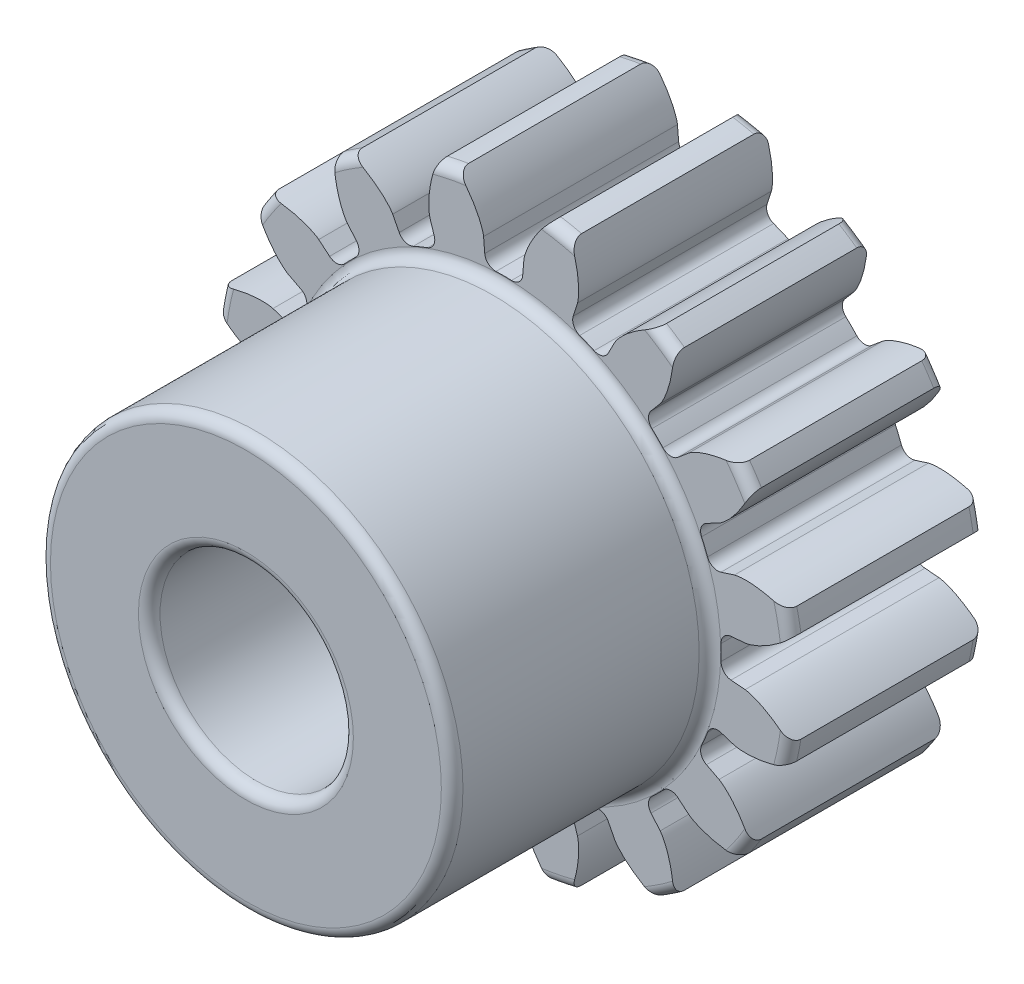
from build123d import *

# Parameters (mm, degrees)
BOSS_EXTRUDE1_DEPTH      = 5.5626
BOSS_EXTRUDE1_DEPTH_BACK = 5.5626
SKETCH3_R                = 7.14375
SKETCH5_W                = 6.35
SKETCH5_H                = 2.06375
SKETCH5_W_2              = 11.1252
SKETCH5_H_2              = 2.38125
FILLET2_R                = 0.266307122
CUT_EXTRUDE1_DEPTH       = 12.532946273
FILLET1_R                = 0.266307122
CIRPATTERN1_COUNT        = 16
FILLET1_OF_CIRPATTERN1_R = 0.266307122


with BuildPart() as part:
    # Sketch3 → Boss-Extrude1 (new, two sides: drawn at the far end of the back side and taken through both)
    with BuildSketch(Plane.XY.offset(-BOSS_EXTRUDE1_DEPTH_BACK)):
        Circle(SKETCH3_R)
    extrude(amount=BOSS_EXTRUDE1_DEPTH + BOSS_EXTRUDE1_DEPTH_BACK)

    # Sketch5 → Cut-Revolve1 (revolve, cut)
    with BuildSketch(Plane(origin=(0, 0, 0), x_dir=(0, 0, -1), z_dir=(1, 0, 0)), mode=Mode.PRIVATE) as cut_revolve1_sk:
        with Locations((-2.3876, 6.111875)):
            Rectangle(SKETCH5_W, SKETCH5_H)
        with Locations((0, 1.190625)):
            Rectangle(SKETCH5_W_2, SKETCH5_H_2)
    revolve(cut_revolve1_sk.sketch.rotate(Axis((0, 0, 5.5626), (0, 0, -1)), 90), axis=Axis((0, 0, 5.5626), (0, 0, -1)), mode=Mode.SUBTRACT)

    # Fillet2
    fillet2_edges = [part.edges().sort_by_distance(p)[0] for p in [
        (-2.38125, 0, 5.5626),
        (-2.38125, 0, -5.5626),
        (-5.08, 0, 5.5626),
        (-5.08, 0, -0.7874),
        (-7.14375, 0, -0.7874),
        (-7.14375, 0, -5.5626),
    ]]
    fillet(fillet2_edges, radius=FILLET2_R)

    # Sketch4 → Cut-Extrude1 (cut, symmetric)
    with BuildSketch(Plane.XY):
        with BuildLine():
            Line((5.339247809, 0.445631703), (5.946372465, 0.496304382))
            add(Edge.make_bspline(
                [(5.946372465, 0.496304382), (5.948275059, 0.496489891), (5.953603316, 0.49709225), (5.963643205, 0.498554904), (5.979968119, 0.501400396), (6.000676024, 0.505699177), (6.027320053, 0.512026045), (6.058537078, 0.520467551), (6.092647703, 0.5307763), (6.129528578, 0.543100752), (6.166104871, 0.556373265), (6.202375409, 0.570518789), (6.238302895, 0.585424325), (6.281567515, 0.604437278), (6.333082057, 0.628564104), (6.39272681, 0.658686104), (6.459674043, 0.695106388), (6.527105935, 0.734615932), (6.592785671, 0.77545143), (6.658323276, 0.818936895), (6.721147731, 0.86258792), (6.785501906, 0.910177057), (6.844449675, 0.955251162), (6.909441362, 1.00820724), (6.961587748, 1.0516637), (7.014543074, 1.098579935), (7.040180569, 1.121712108), (7.05322488, 1.133659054)],
                knots=[0, 0, 0, 0, 0, 0.005376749, 0.015083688, 0.02853182, 0.04661014, 0.064854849, 0.092110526, 0.119476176, 0.146842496, 0.174208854, 0.201574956, 0.228941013, 0.256307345, 0.307035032, 0.361767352, 0.416499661, 0.471231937, 0.525964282, 0.580696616, 0.635428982, 0.690161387, 0.744893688, 0.799626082, 0.854358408, 0.909090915, 0.909090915, 0.909090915, 0.909090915, 0.909090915], degree=4))
            ThreePointArc((7.05322488, 1.133659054), (7.14375, 0), (7.05322488, -1.133659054))
            add(Edge.make_bspline(
                [(5.946372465, -0.496304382), (5.948275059, -0.496489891), (5.953603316, -0.49709225), (5.963643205, -0.498554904), (5.979968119, -0.501400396), (6.000676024, -0.505699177), (6.027320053, -0.512026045), (6.058537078, -0.520467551), (6.092647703, -0.5307763), (6.129528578, -0.543100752), (6.166104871, -0.556373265), (6.202375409, -0.570518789), (6.238302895, -0.585424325), (6.281567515, -0.604437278), (6.333082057, -0.628564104), (6.39272681, -0.658686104), (6.459674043, -0.695106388), (6.527105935, -0.734615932), (6.592785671, -0.77545143), (6.658323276, -0.818936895), (6.721147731, -0.86258792), (6.785501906, -0.910177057), (6.844449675, -0.955251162), (6.909441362, -1.00820724), (6.961587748, -1.0516637), (7.014543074, -1.098579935), (7.040180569, -1.121712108), (7.05322488, -1.133659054)],
                knots=[0, 0, 0, 0, 0, 0.005376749, 0.015083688, 0.02853182, 0.04661014, 0.064854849, 0.092110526, 0.119476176, 0.146842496, 0.174208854, 0.201574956, 0.228941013, 0.256307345, 0.307035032, 0.361767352, 0.416499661, 0.471231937, 0.525964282, 0.580696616, 0.635428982, 0.690161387, 0.744893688, 0.799626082, 0.854358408, 0.909090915, 0.909090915, 0.909090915, 0.909090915, 0.909090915], degree=4))
            Line((5.946372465, -0.496304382), (5.339247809, -0.445631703))
            ThreePointArc((5.339247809, -0.445631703), (5.3578125, 0), (5.339247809, 0.445631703))
        make_face()
    cut_extrude1 = extrude(amount=CUT_EXTRUDE1_DEPTH, both=True, mode=Mode.SUBTRACT)

    # Fillet1
    fillet1_edges = [part.edges().sort_by_distance(p)[0] for p in [
        (5.339247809, -0.445631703, -3.175),
        (5.339247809, 0.445631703, -3.175),
    ]]
    fillet(fillet1_edges, radius=FILLET1_R)

    # CirPattern1: Cut-Extrude1 ×16 about axis
    cirpattern1_axis = Axis((0, 0, 5.5626), (0, 0, -1))
    for i in range(1, CIRPATTERN1_COUNT):
        add(cut_extrude1.rotate(cirpattern1_axis, i * 360 / CIRPATTERN1_COUNT), mode=Mode.SUBTRACT)

    # Fillet1 of CirPattern1
    fillet1_of_cirpattern1_edges = [part.edges().sort_by_distance(p)[0] for p in [
        (4.762285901, -2.454951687, -3.175),
        (5.10335764, -1.631531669, -3.175),
        (3.460309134, -4.090527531, -3.175),
        (4.090527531, -3.460309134, -3.175),
        (1.631531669, -5.10335764, -3.175),
        (2.454951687, -4.762285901, -3.175),
        (-0.445631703, -5.339247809, -3.175),
        (0.445631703, -5.339247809, -3.175),
        (-2.454951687, -4.762285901, -3.175),
        (-1.631531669, -5.10335764, -3.175),
        (-4.090527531, -3.460309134, -3.175),
        (-3.460309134, -4.090527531, -3.175),
        (-5.10335764, -1.631531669, -3.175),
        (-4.762285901, -2.454951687, -3.175),
        (-5.339247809, 0.445631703, -3.175),
        (-5.339247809, -0.445631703, -3.175),
        (-4.762285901, 2.454951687, -3.175),
        (-5.10335764, 1.631531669, -3.175),
        (-3.460309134, 4.090527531, -3.175),
        (-4.090527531, 3.460309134, -3.175),
        (-1.631531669, 5.10335764, -3.175),
        (-2.454951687, 4.762285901, -3.175),
        (0.445631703, 5.339247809, -3.175),
        (-0.445631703, 5.339247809, -3.175),
        (2.454951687, 4.762285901, -3.175),
        (1.631531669, 5.10335764, -3.175),
        (4.090527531, 3.460309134, -3.175),
        (3.460309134, 4.090527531, -3.175),
        (5.10335764, 1.631531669, -3.175),
        (4.762285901, 2.454951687, -3.175),
    ]]
    fillet(fillet1_of_cirpattern1_edges, radius=FILLET1_OF_CIRPATTERN1_R)


solid = part.part
